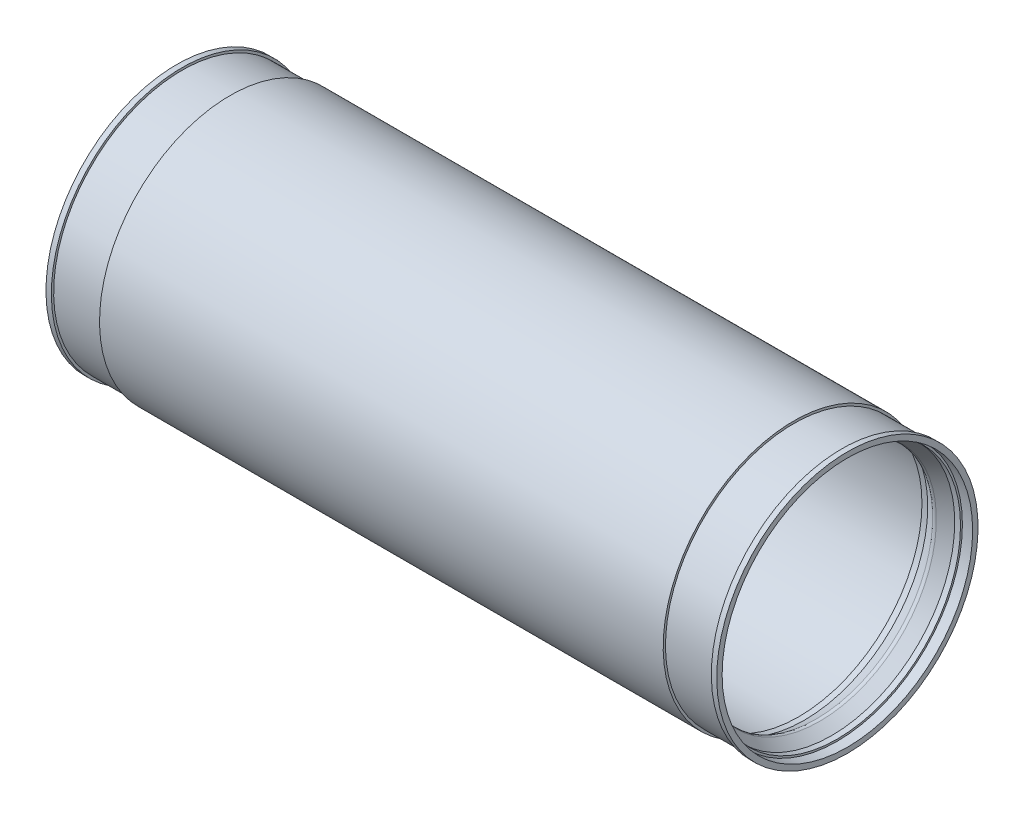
ISO-10303-21;
HEADER;
FILE_DESCRIPTION(('STEP AP214'),'2;1');
FILE_NAME('part.step','',(''),(''),'','','');
FILE_SCHEMA(('AUTOMOTIVE_DESIGN { 1 0 10303 214 1 1 1 1 }'));
ENDSEC;
DATA;
#1=APPLICATION_CONTEXT('core data for automotive mechanical design processes');
#2=APPLICATION_PROTOCOL_DEFINITION('international standard','automotive_design',2000,#1);
#3=PRODUCT_CONTEXT('',#1,'mechanical');
#4=PRODUCT('Part','Part','',(#3));
#5=PRODUCT_RELATED_PRODUCT_CATEGORY('part','',(#4));
#6=PRODUCT_DEFINITION_FORMATION('','',#4);
#7=PRODUCT_DEFINITION_CONTEXT('part definition',#1,'design');
#8=PRODUCT_DEFINITION('design','',#6,#7);
#9=PRODUCT_DEFINITION_SHAPE('','',#8);
#10=(LENGTH_UNIT() NAMED_UNIT(*) SI_UNIT(.MILLI.,.METRE.));
#11=(NAMED_UNIT(*) PLANE_ANGLE_UNIT() SI_UNIT($,.RADIAN.));
#12=(NAMED_UNIT(*) SI_UNIT($,.STERADIAN.) SOLID_ANGLE_UNIT());
#13=UNCERTAINTY_MEASURE_WITH_UNIT(LENGTH_MEASURE(1.E-05),#10,'distance_accuracy_value','');
#14=(GEOMETRIC_REPRESENTATION_CONTEXT(3) GLOBAL_UNCERTAINTY_ASSIGNED_CONTEXT((#13)) GLOBAL_UNIT_ASSIGNED_CONTEXT((#10,
#11,#12)) REPRESENTATION_CONTEXT('',''));
#15=CARTESIAN_POINT('',(0.,0.,0.));
#16=DIRECTION('',(0.,0.,1.));
#17=DIRECTION('',(1.,0.,0.));
#18=AXIS2_PLACEMENT_3D('',#15,#16,#17);
#19=CARTESIAN_POINT('',(-16.0133867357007,-82.55,0.));
#20=DIRECTION('',(-1.,0.,0.));
#21=DIRECTION('',(0.,-1.,0.));
#22=AXIS2_PLACEMENT_3D('',#19,#20,#21);
#23=CYLINDRICAL_SURFACE('',#22,82.55);
#24=CARTESIAN_POINT('',(6.73368093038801,-82.55,0.));
#25=DIRECTION('',(-1.,0.,0.));
#26=DIRECTION('',(0.,-1.,0.));
#27=AXIS2_PLACEMENT_3D('',#24,#25,#26);
#28=CIRCLE('',#27,82.55);
#29=CARTESIAN_POINT('',(6.73368093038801,-165.1,0.));
#30=VERTEX_POINT('',#29);
#31=EDGE_CURVE('E10',#30,#30,#28,.T.);
#32=ORIENTED_EDGE('',*,*,#31,.F.);
#33=EDGE_LOOP('',(#32));
#34=FACE_BOUND('',#33,.T.);
#35=CARTESIAN_POINT('',(0.,-82.55,0.));
#36=DIRECTION('',(-1.,0.,0.));
#37=DIRECTION('',(0.,-1.,0.));
#38=AXIS2_PLACEMENT_3D('',#35,#36,#37);
#39=CIRCLE('',#38,82.55);
#40=CARTESIAN_POINT('',(0.,-165.1,0.));
#41=VERTEX_POINT('',#40);
#42=EDGE_CURVE('E116',#41,#41,#39,.T.);
#43=ORIENTED_EDGE('',*,*,#42,.T.);
#44=EDGE_LOOP('',(#43));
#45=FACE_BOUND('',#44,.T.);
#46=ADVANCED_FACE('F28',(#34,#45),#23,.F.);
#47=CARTESIAN_POINT('',(6.73368093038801,-1.26435608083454,0.));
#48=DIRECTION('',(1.,0.,0.));
#49=DIRECTION('',(0.,1.,0.));
#50=AXIS2_PLACEMENT_3D('',#47,#48,#49);
#51=PLANE('',#50);
#52=CARTESIAN_POINT('',(6.73368093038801,-82.55,0.));
#53=DIRECTION('',(-1.,0.,0.));
#54=DIRECTION('',(0.,-1.,0.));
#55=AXIS2_PLACEMENT_3D('',#52,#53,#54);
#56=CIRCLE('',#55,81.2856439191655);
#57=CARTESIAN_POINT('',(6.73368093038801,-163.835643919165,0.));
#58=VERTEX_POINT('',#57);
#59=EDGE_CURVE('E34',#58,#58,#56,.T.);
#60=ORIENTED_EDGE('',*,*,#59,.F.);
#61=EDGE_LOOP('',(#60));
#62=FACE_BOUND('',#61,.T.);
#63=ORIENTED_EDGE('',*,*,#31,.T.);
#64=EDGE_LOOP('',(#63));
#65=FACE_BOUND('',#64,.T.);
#66=ADVANCED_FACE('F273',(#62,#65),#51,.F.);
#67=CARTESIAN_POINT('',(-16.0133867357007,-82.55,0.));
#68=DIRECTION('',(-1.,0.,0.));
#69=DIRECTION('',(0.,-1.,0.));
#70=AXIS2_PLACEMENT_3D('',#67,#68,#69);
#71=CYLINDRICAL_SURFACE('',#70,81.2856439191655);
#72=CARTESIAN_POINT('',(10.543680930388,-82.55,0.));
#73=DIRECTION('',(-1.,0.,0.));
#74=DIRECTION('',(0.,-1.,0.));
#75=AXIS2_PLACEMENT_3D('',#72,#73,#74);
#76=CIRCLE('',#75,81.2856439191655);
#77=CARTESIAN_POINT('',(10.543680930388,-163.835643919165,0.));
#78=VERTEX_POINT('',#77);
#79=EDGE_CURVE('E38',#78,#78,#76,.T.);
#80=ORIENTED_EDGE('',*,*,#79,.F.);
#81=EDGE_LOOP('',(#80));
#82=FACE_BOUND('',#81,.T.);
#83=ORIENTED_EDGE('',*,*,#59,.T.);
#84=EDGE_LOOP('',(#83));
#85=FACE_BOUND('',#84,.T.);
#86=ADVANCED_FACE('F268',(#82,#85),#71,.F.);
#87=CARTESIAN_POINT('',(10.543680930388,-82.55,0.));
#88=DIRECTION('',(-1.,0.,0.));
#89=DIRECTION('',(0.,-1.,0.));
#90=AXIS2_PLACEMENT_3D('',#87,#88,#89);
#91=CONICAL_SURFACE('',#90,81.2856439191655,0.580420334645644);
#92=CARTESIAN_POINT('',(18.0687160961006,-82.55,0.));
#93=DIRECTION('',(-1.,0.,0.));
#94=DIRECTION('',(0.,-1.,0.));
#95=AXIS2_PLACEMENT_3D('',#92,#93,#94);
#96=CIRCLE('',#95,76.3509563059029);
#97=CARTESIAN_POINT('',(18.0687160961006,-158.900956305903,0.));
#98=VERTEX_POINT('',#97);
#99=EDGE_CURVE('E42',#98,#98,#96,.T.);
#100=ORIENTED_EDGE('',*,*,#99,.F.);
#101=EDGE_LOOP('',(#100));
#102=FACE_BOUND('',#101,.T.);
#103=ORIENTED_EDGE('',*,*,#79,.T.);
#104=EDGE_LOOP('',(#103));
#105=FACE_BOUND('',#104,.T.);
#106=ADVANCED_FACE('F262',(#102,#105),#91,.F.);
#107=CARTESIAN_POINT('',(19.431,-82.55,0.));
#108=DIRECTION('',(-1.,0.,0.));
#109=DIRECTION('',(0.,-1.,0.));
#110=AXIS2_PLACEMENT_3D('',#107,#108,#109);
#111=TOROIDAL_SURFACE('',#110,79.2188488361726,3.175);
#112=CARTESIAN_POINT('',(20.8597836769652,-82.55,0.));
#113=DIRECTION('',(-1.,0.,0.));
#114=DIRECTION('',(0.,-1.,0.));
#115=AXIS2_PLACEMENT_3D('',#112,#113,#114);
#116=CIRCLE('',#115,76.3835001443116);
#117=CARTESIAN_POINT('',(20.8597836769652,-158.933500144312,0.));
#118=VERTEX_POINT('',#117);
#119=EDGE_CURVE('E47',#118,#118,#116,.T.);
#120=ORIENTED_EDGE('',*,*,#119,.F.);
#121=EDGE_LOOP('',(#120));
#122=FACE_BOUND('',#121,.T.);
#123=ORIENTED_EDGE('',*,*,#99,.T.);
#124=EDGE_LOOP('',(#123));
#125=FACE_BOUND('',#124,.T.);
#126=ADVANCED_FACE('F256',(#122,#125),#111,.T.);
#127=CARTESIAN_POINT('',(20.8597836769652,-82.55,0.));
#128=DIRECTION('',(1.,0.,0.));
#129=DIRECTION('',(0.,1.,0.));
#130=AXIS2_PLACEMENT_3D('',#127,#128,#129);
#131=CONICAL_SURFACE('',#130,76.3835001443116,0.466777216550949);
#132=CARTESIAN_POINT('',(28.4981397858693,-82.55,0.));
#133=DIRECTION('',(-1.,0.,0.));
#134=DIRECTION('',(0.,-1.,0.));
#135=AXIS2_PLACEMENT_3D('',#132,#133,#134);
#136=CIRCLE('',#135,80.2326064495);
#137=CARTESIAN_POINT('',(28.4981397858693,-162.7826064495,0.));
#138=VERTEX_POINT('',#137);
#139=EDGE_CURVE('E50',#138,#138,#136,.T.);
#140=ORIENTED_EDGE('',*,*,#139,.F.);
#141=EDGE_LOOP('',(#140));
#142=FACE_BOUND('',#141,.T.);
#143=ORIENTED_EDGE('',*,*,#119,.T.);
#144=EDGE_LOOP('',(#143));
#145=FACE_BOUND('',#144,.T.);
#146=ADVANCED_FACE('F250',(#142,#145),#131,.F.);
#147=CARTESIAN_POINT('',(-16.0133867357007,-82.55,0.));
#148=DIRECTION('',(-1.,0.,0.));
#149=DIRECTION('',(0.,-1.,0.));
#150=AXIS2_PLACEMENT_3D('',#147,#148,#149);
#151=CYLINDRICAL_SURFACE('',#150,80.2326064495);
#152=CARTESIAN_POINT('',(32.131,-82.55,0.));
#153=DIRECTION('',(-1.,0.,0.));
#154=DIRECTION('',(0.,-1.,0.));
#155=AXIS2_PLACEMENT_3D('',#152,#153,#154);
#156=CIRCLE('',#155,80.2326064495);
#157=CARTESIAN_POINT('',(32.131,-162.7826064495,0.));
#158=VERTEX_POINT('',#157);
#159=EDGE_CURVE('E53',#158,#158,#156,.T.);
#160=ORIENTED_EDGE('',*,*,#159,.F.);
#161=EDGE_LOOP('',(#160));
#162=FACE_BOUND('',#161,.T.);
#163=ORIENTED_EDGE('',*,*,#139,.T.);
#164=EDGE_LOOP('',(#163));
#165=FACE_BOUND('',#164,.T.);
#166=ADVANCED_FACE('F244',(#162,#165),#151,.F.);
#167=CARTESIAN_POINT('',(32.131,-2.31739355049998,0.));
#168=DIRECTION('',(-1.,0.,0.));
#169=DIRECTION('',(0.,-1.,0.));
#170=AXIS2_PLACEMENT_3D('',#167,#168,#169);
#171=PLANE('',#170);
#172=CARTESIAN_POINT('',(32.131,-82.55,0.));
#173=DIRECTION('',(-1.,0.,0.));
#174=DIRECTION('',(0.,-1.,0.));
#175=AXIS2_PLACEMENT_3D('',#172,#173,#174);
#176=CIRCLE('',#175,82.55);
#177=CARTESIAN_POINT('',(32.131,-165.1,0.));
#178=VERTEX_POINT('',#177);
#179=EDGE_CURVE('E56',#178,#178,#176,.T.);
#180=ORIENTED_EDGE('',*,*,#179,.F.);
#181=EDGE_LOOP('',(#180));
#182=FACE_BOUND('',#181,.T.);
#183=ORIENTED_EDGE('',*,*,#159,.T.);
#184=EDGE_LOOP('',(#183));
#185=FACE_BOUND('',#184,.T.);
#186=ADVANCED_FACE('F238',(#182,#185),#171,.F.);
#187=CARTESIAN_POINT('',(-16.0133867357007,-82.55,0.));
#188=DIRECTION('',(-1.,0.,0.));
#189=DIRECTION('',(0.,-1.,0.));
#190=AXIS2_PLACEMENT_3D('',#187,#188,#189);
#191=CYLINDRICAL_SURFACE('',#190,82.55);
#192=CARTESIAN_POINT('',(409.956,-82.55,0.));
#193=DIRECTION('',(-1.,0.,0.));
#194=DIRECTION('',(0.,-1.,0.));
#195=AXIS2_PLACEMENT_3D('',#192,#193,#194);
#196=CIRCLE('',#195,82.55);
#197=CARTESIAN_POINT('',(409.956,-165.1,0.));
#198=VERTEX_POINT('',#197);
#199=EDGE_CURVE('E59',#198,#198,#196,.T.);
#200=ORIENTED_EDGE('',*,*,#199,.F.);
#201=EDGE_LOOP('',(#200));
#202=FACE_BOUND('',#201,.T.);
#203=ORIENTED_EDGE('',*,*,#179,.T.);
#204=EDGE_LOOP('',(#203));
#205=FACE_BOUND('',#204,.T.);
#206=ADVANCED_FACE('F232',(#202,#205),#191,.F.);
#207=CARTESIAN_POINT('',(409.956,-1.27,0.));
#208=DIRECTION('',(1.,0.,0.));
#209=DIRECTION('',(0.,1.,0.));
#210=AXIS2_PLACEMENT_3D('',#207,#208,#209);
#211=PLANE('',#210);
#212=CARTESIAN_POINT('',(409.956,-82.55,0.));
#213=DIRECTION('',(-1.,0.,0.));
#214=DIRECTION('',(0.,-1.,0.));
#215=AXIS2_PLACEMENT_3D('',#212,#213,#214);
#216=CIRCLE('',#215,81.28);
#217=CARTESIAN_POINT('',(409.956,-163.83,0.));
#218=VERTEX_POINT('',#217);
#219=EDGE_CURVE('E62',#218,#218,#216,.T.);
#220=ORIENTED_EDGE('',*,*,#219,.F.);
#221=EDGE_LOOP('',(#220));
#222=FACE_BOUND('',#221,.T.);
#223=ORIENTED_EDGE('',*,*,#199,.T.);
#224=EDGE_LOOP('',(#223));
#225=FACE_BOUND('',#224,.T.);
#226=ADVANCED_FACE('F226',(#222,#225),#211,.F.);
#227=CARTESIAN_POINT('',(-16.0133867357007,-82.55,0.));
#228=DIRECTION('',(-1.,0.,0.));
#229=DIRECTION('',(0.,-1.,0.));
#230=AXIS2_PLACEMENT_3D('',#227,#228,#229);
#231=CYLINDRICAL_SURFACE('',#230,81.28);
#232=CARTESIAN_POINT('',(413.766,-82.55,0.));
#233=DIRECTION('',(-1.,0.,0.));
#234=DIRECTION('',(0.,-1.,0.));
#235=AXIS2_PLACEMENT_3D('',#232,#233,#234);
#236=CIRCLE('',#235,81.28);
#237=CARTESIAN_POINT('',(413.766,-163.83,0.));
#238=VERTEX_POINT('',#237);
#239=EDGE_CURVE('E65',#238,#238,#236,.T.);
#240=ORIENTED_EDGE('',*,*,#239,.F.);
#241=EDGE_LOOP('',(#240));
#242=FACE_BOUND('',#241,.T.);
#243=ORIENTED_EDGE('',*,*,#219,.T.);
#244=EDGE_LOOP('',(#243));
#245=FACE_BOUND('',#244,.T.);
#246=ADVANCED_FACE('F220',(#242,#245),#231,.F.);
#247=CARTESIAN_POINT('',(413.766,-82.55,0.));
#248=DIRECTION('',(-1.,0.,0.));
#249=DIRECTION('',(0.,-1.,0.));
#250=AXIS2_PLACEMENT_3D('',#247,#248,#249);
#251=CONICAL_SURFACE('',#250,81.28,0.523598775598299);
#252=CARTESIAN_POINT('',(421.423367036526,-82.55,0.));
#253=DIRECTION('',(-1.,0.,0.));
#254=DIRECTION('',(0.,-1.,0.));
#255=AXIS2_PLACEMENT_3D('',#252,#253,#254);
#256=CIRCLE('',#255,76.8590170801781);
#257=CARTESIAN_POINT('',(421.423367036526,-159.409017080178,0.));
#258=VERTEX_POINT('',#257);
#259=EDGE_CURVE('E68',#258,#258,#256,.T.);
#260=ORIENTED_EDGE('',*,*,#259,.F.);
#261=EDGE_LOOP('',(#260));
#262=FACE_BOUND('',#261,.T.);
#263=ORIENTED_EDGE('',*,*,#239,.T.);
#264=EDGE_LOOP('',(#263));
#265=FACE_BOUND('',#264,.T.);
#266=ADVANCED_FACE('F214',(#262,#265),#251,.F.);
#267=CARTESIAN_POINT('',(422.656,-82.55,0.));
#268=DIRECTION('',(-1.,0.,0.));
#269=DIRECTION('',(0.,-1.,0.));
#270=AXIS2_PLACEMENT_3D('',#267,#268,#269);
#271=TOROIDAL_SURFACE('',#270,78.994,2.4652659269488);
#272=CARTESIAN_POINT('',(423.888632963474,-82.55,0.));
#273=DIRECTION('',(-1.,0.,0.));
#274=DIRECTION('',(0.,-1.,0.));
#275=AXIS2_PLACEMENT_3D('',#272,#273,#274);
#276=CIRCLE('',#275,76.8590170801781);
#277=CARTESIAN_POINT('',(423.888632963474,-159.409017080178,0.));
#278=VERTEX_POINT('',#277);
#279=EDGE_CURVE('E71',#278,#278,#276,.T.);
#280=ORIENTED_EDGE('',*,*,#279,.F.);
#281=EDGE_LOOP('',(#280));
#282=FACE_BOUND('',#281,.T.);
#283=ORIENTED_EDGE('',*,*,#259,.T.);
#284=EDGE_LOOP('',(#283));
#285=FACE_BOUND('',#284,.T.);
#286=ADVANCED_FACE('F208',(#282,#285),#271,.T.);
#287=CARTESIAN_POINT('',(423.888632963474,-82.55,0.));
#288=DIRECTION('',(1.,0.,0.));
#289=DIRECTION('',(0.,1.,0.));
#290=AXIS2_PLACEMENT_3D('',#287,#288,#289);
#291=CONICAL_SURFACE('',#290,76.8590170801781,0.5235987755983);
#292=CARTESIAN_POINT('',(431.546,-82.55,0.));
#293=DIRECTION('',(-1.,0.,0.));
#294=DIRECTION('',(0.,-1.,0.));
#295=AXIS2_PLACEMENT_3D('',#292,#293,#294);
#296=CIRCLE('',#295,81.28);
#297=CARTESIAN_POINT('',(431.546,-163.83,0.));
#298=VERTEX_POINT('',#297);
#299=EDGE_CURVE('E74',#298,#298,#296,.T.);
#300=ORIENTED_EDGE('',*,*,#299,.F.);
#301=EDGE_LOOP('',(#300));
#302=FACE_BOUND('',#301,.T.);
#303=ORIENTED_EDGE('',*,*,#279,.T.);
#304=EDGE_LOOP('',(#303));
#305=FACE_BOUND('',#304,.T.);
#306=ADVANCED_FACE('F202',(#302,#305),#291,.F.);
#307=CARTESIAN_POINT('',(-16.0133867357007,-82.55,0.));
#308=DIRECTION('',(-1.,0.,0.));
#309=DIRECTION('',(0.,-1.,0.));
#310=AXIS2_PLACEMENT_3D('',#307,#308,#309);
#311=CYLINDRICAL_SURFACE('',#310,81.28);
#312=CARTESIAN_POINT('',(435.356,-82.55,0.));
#313=DIRECTION('',(-1.,0.,0.));
#314=DIRECTION('',(0.,-1.,0.));
#315=AXIS2_PLACEMENT_3D('',#312,#313,#314);
#316=CIRCLE('',#315,81.28);
#317=CARTESIAN_POINT('',(435.356,-163.83,0.));
#318=VERTEX_POINT('',#317);
#319=EDGE_CURVE('E77',#318,#318,#316,.T.);
#320=ORIENTED_EDGE('',*,*,#319,.F.);
#321=EDGE_LOOP('',(#320));
#322=FACE_BOUND('',#321,.T.);
#323=ORIENTED_EDGE('',*,*,#299,.T.);
#324=EDGE_LOOP('',(#323));
#325=FACE_BOUND('',#324,.T.);
#326=ADVANCED_FACE('F196',(#322,#325),#311,.F.);
#327=CARTESIAN_POINT('',(435.356,-1.27,0.));
#328=DIRECTION('',(-1.,0.,0.));
#329=DIRECTION('',(0.,-1.,0.));
#330=AXIS2_PLACEMENT_3D('',#327,#328,#329);
#331=PLANE('',#330);
#332=CARTESIAN_POINT('',(435.356,-82.55,0.));
#333=DIRECTION('',(-1.,0.,0.));
#334=DIRECTION('',(0.,-1.,0.));
#335=AXIS2_PLACEMENT_3D('',#332,#333,#334);
#336=CIRCLE('',#335,82.55);
#337=CARTESIAN_POINT('',(435.356,-165.1,0.));
#338=VERTEX_POINT('',#337);
#339=EDGE_CURVE('E80',#338,#338,#336,.T.);
#340=ORIENTED_EDGE('',*,*,#339,.F.);
#341=EDGE_LOOP('',(#340));
#342=FACE_BOUND('',#341,.T.);
#343=ORIENTED_EDGE('',*,*,#319,.T.);
#344=EDGE_LOOP('',(#343));
#345=FACE_BOUND('',#344,.T.);
#346=ADVANCED_FACE('F190',(#342,#345),#331,.F.);
#347=CARTESIAN_POINT('',(-16.0133867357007,-82.55,0.));
#348=DIRECTION('',(-1.,0.,0.));
#349=DIRECTION('',(0.,-1.,0.));
#350=AXIS2_PLACEMENT_3D('',#347,#348,#349);
#351=CYLINDRICAL_SURFACE('',#350,82.55);
#352=CARTESIAN_POINT('',(442.087,-82.55,0.));
#353=DIRECTION('',(-1.,0.,0.));
#354=DIRECTION('',(0.,-1.,0.));
#355=AXIS2_PLACEMENT_3D('',#352,#353,#354);
#356=CIRCLE('',#355,82.55);
#357=CARTESIAN_POINT('',(442.087,-165.1,0.));
#358=VERTEX_POINT('',#357);
#359=EDGE_CURVE('E83',#358,#358,#356,.T.);
#360=ORIENTED_EDGE('',*,*,#359,.F.);
#361=EDGE_LOOP('',(#360));
#362=FACE_BOUND('',#361,.T.);
#363=ORIENTED_EDGE('',*,*,#339,.T.);
#364=EDGE_LOOP('',(#363));
#365=FACE_BOUND('',#364,.T.);
#366=ADVANCED_FACE('F184',(#362,#365),#351,.F.);
#367=CARTESIAN_POINT('',(442.087,0.,0.));
#368=DIRECTION('',(-1.,0.,0.));
#369=DIRECTION('',(0.,-1.,0.));
#370=AXIS2_PLACEMENT_3D('',#367,#368,#369);
#371=PLANE('',#370);
#372=CARTESIAN_POINT('',(442.087,-82.55,0.));
#373=DIRECTION('',(-1.,0.,0.));
#374=DIRECTION('',(0.,-1.,0.));
#375=AXIS2_PLACEMENT_3D('',#372,#373,#374);
#376=CIRCLE('',#375,86.106);
#377=CARTESIAN_POINT('',(442.087,-168.656,0.));
#378=VERTEX_POINT('',#377);
#379=EDGE_CURVE('E86',#378,#378,#376,.T.);
#380=ORIENTED_EDGE('',*,*,#379,.F.);
#381=EDGE_LOOP('',(#380));
#382=FACE_BOUND('',#381,.T.);
#383=ORIENTED_EDGE('',*,*,#359,.T.);
#384=EDGE_LOOP('',(#383));
#385=FACE_BOUND('',#384,.T.);
#386=ADVANCED_FACE('F178',(#382,#385),#371,.F.);
#387=CARTESIAN_POINT('',(-16.0133867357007,-82.55,0.));
#388=DIRECTION('',(-1.,0.,0.));
#389=DIRECTION('',(0.,-1.,0.));
#390=AXIS2_PLACEMENT_3D('',#387,#388,#389);
#391=CYLINDRICAL_SURFACE('',#390,86.106);
#392=CARTESIAN_POINT('',(438.531,-82.55,0.));
#393=DIRECTION('',(-1.,0.,0.));
#394=DIRECTION('',(0.,-1.,0.));
#395=AXIS2_PLACEMENT_3D('',#392,#393,#394);
#396=CIRCLE('',#395,86.106);
#397=CARTESIAN_POINT('',(438.531,-168.656,0.));
#398=VERTEX_POINT('',#397);
#399=EDGE_CURVE('E89',#398,#398,#396,.T.);
#400=ORIENTED_EDGE('',*,*,#399,.F.);
#401=EDGE_LOOP('',(#400));
#402=FACE_BOUND('',#401,.T.);
#403=ORIENTED_EDGE('',*,*,#379,.T.);
#404=EDGE_LOOP('',(#403));
#405=FACE_BOUND('',#404,.T.);
#406=ADVANCED_FACE('F172',(#402,#405),#391,.T.);
#407=CARTESIAN_POINT('',(438.531,3.55599999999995,0.));
#408=DIRECTION('',(1.,0.,0.));
#409=DIRECTION('',(0.,1.,0.));
#410=AXIS2_PLACEMENT_3D('',#407,#408,#409);
#411=PLANE('',#410);
#412=CARTESIAN_POINT('',(438.531,-82.55,0.));
#413=DIRECTION('',(-1.,0.,0.));
#414=DIRECTION('',(0.,-1.,0.));
#415=AXIS2_PLACEMENT_3D('',#412,#413,#414);
#416=CIRCLE('',#415,84.582);
#417=CARTESIAN_POINT('',(438.531,-167.132,0.));
#418=VERTEX_POINT('',#417);
#419=EDGE_CURVE('E92',#418,#418,#416,.T.);
#420=ORIENTED_EDGE('',*,*,#419,.F.);
#421=EDGE_LOOP('',(#420));
#422=FACE_BOUND('',#421,.T.);
#423=ORIENTED_EDGE('',*,*,#399,.T.);
#424=EDGE_LOOP('',(#423));
#425=FACE_BOUND('',#424,.T.);
#426=ADVANCED_FACE('F166',(#422,#425),#411,.F.);
#427=CARTESIAN_POINT('',(-16.0133867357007,-82.55,0.));
#428=DIRECTION('',(-1.,0.,0.));
#429=DIRECTION('',(0.,-1.,0.));
#430=AXIS2_PLACEMENT_3D('',#427,#428,#429);
#431=CYLINDRICAL_SURFACE('',#430,84.582);
#432=CARTESIAN_POINT('',(406.781,-82.55,0.));
#433=DIRECTION('',(-1.,0.,0.));
#434=DIRECTION('',(0.,-1.,0.));
#435=AXIS2_PLACEMENT_3D('',#432,#433,#434);
#436=CIRCLE('',#435,84.582);
#437=CARTESIAN_POINT('',(406.781,-167.132,0.));
#438=VERTEX_POINT('',#437);
#439=EDGE_CURVE('E95',#438,#438,#436,.T.);
#440=ORIENTED_EDGE('',*,*,#439,.F.);
#441=EDGE_LOOP('',(#440));
#442=FACE_BOUND('',#441,.T.);
#443=ORIENTED_EDGE('',*,*,#419,.T.);
#444=EDGE_LOOP('',(#443));
#445=FACE_BOUND('',#444,.T.);
#446=ADVANCED_FACE('F160',(#442,#445),#431,.T.);
#447=CARTESIAN_POINT('',(406.781,2.03199999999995,0.));
#448=DIRECTION('',(-1.,0.,0.));
#449=DIRECTION('',(0.,-1.,0.));
#450=AXIS2_PLACEMENT_3D('',#447,#448,#449);
#451=PLANE('',#450);
#452=CARTESIAN_POINT('',(406.781,-82.55,0.));
#453=DIRECTION('',(-1.,0.,0.));
#454=DIRECTION('',(0.,-1.,0.));
#455=AXIS2_PLACEMENT_3D('',#452,#453,#454);
#456=CIRCLE('',#455,86.106);
#457=CARTESIAN_POINT('',(406.781,-168.656,0.));
#458=VERTEX_POINT('',#457);
#459=EDGE_CURVE('E98',#458,#458,#456,.T.);
#460=ORIENTED_EDGE('',*,*,#459,.F.);
#461=EDGE_LOOP('',(#460));
#462=FACE_BOUND('',#461,.T.);
#463=ORIENTED_EDGE('',*,*,#439,.T.);
#464=EDGE_LOOP('',(#463));
#465=FACE_BOUND('',#464,.T.);
#466=ADVANCED_FACE('F154',(#462,#465),#451,.F.);
#467=CARTESIAN_POINT('',(-16.0133867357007,-82.55,0.));
#468=DIRECTION('',(-1.,0.,0.));
#469=DIRECTION('',(0.,-1.,0.));
#470=AXIS2_PLACEMENT_3D('',#467,#468,#469);
#471=CYLINDRICAL_SURFACE('',#470,86.106);
#472=CARTESIAN_POINT('',(35.306,-82.55,0.));
#473=DIRECTION('',(-1.,0.,0.));
#474=DIRECTION('',(0.,-1.,0.));
#475=AXIS2_PLACEMENT_3D('',#472,#473,#474);
#476=CIRCLE('',#475,86.106);
#477=CARTESIAN_POINT('',(35.306,-168.656,0.));
#478=VERTEX_POINT('',#477);
#479=EDGE_CURVE('E101',#478,#478,#476,.T.);
#480=ORIENTED_EDGE('',*,*,#479,.F.);
#481=EDGE_LOOP('',(#480));
#482=FACE_BOUND('',#481,.T.);
#483=ORIENTED_EDGE('',*,*,#459,.T.);
#484=EDGE_LOOP('',(#483));
#485=FACE_BOUND('',#484,.T.);
#486=ADVANCED_FACE('F148',(#482,#485),#471,.T.);
#487=CARTESIAN_POINT('',(35.306,2.032,0.));
#488=DIRECTION('',(1.,0.,0.));
#489=DIRECTION('',(0.,1.,0.));
#490=AXIS2_PLACEMENT_3D('',#487,#488,#489);
#491=PLANE('',#490);
#492=CARTESIAN_POINT('',(35.306,-82.55,0.));
#493=DIRECTION('',(-1.,0.,0.));
#494=DIRECTION('',(0.,-1.,0.));
#495=AXIS2_PLACEMENT_3D('',#492,#493,#494);
#496=CIRCLE('',#495,84.582);
#497=CARTESIAN_POINT('',(35.306,-167.132,0.));
#498=VERTEX_POINT('',#497);
#499=EDGE_CURVE('E104',#498,#498,#496,.T.);
#500=ORIENTED_EDGE('',*,*,#499,.F.);
#501=EDGE_LOOP('',(#500));
#502=FACE_BOUND('',#501,.T.);
#503=ORIENTED_EDGE('',*,*,#479,.T.);
#504=EDGE_LOOP('',(#503));
#505=FACE_BOUND('',#504,.T.);
#506=ADVANCED_FACE('F142',(#502,#505),#491,.F.);
#507=CARTESIAN_POINT('',(-16.0133867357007,-82.55,0.));
#508=DIRECTION('',(-1.,0.,0.));
#509=DIRECTION('',(0.,-1.,0.));
#510=AXIS2_PLACEMENT_3D('',#507,#508,#509);
#511=CYLINDRICAL_SURFACE('',#510,84.582);
#512=CARTESIAN_POINT('',(3.556,-82.55,0.));
#513=DIRECTION('',(-1.,0.,0.));
#514=DIRECTION('',(0.,-1.,0.));
#515=AXIS2_PLACEMENT_3D('',#512,#513,#514);
#516=CIRCLE('',#515,84.582);
#517=CARTESIAN_POINT('',(3.55599999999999,-167.132,0.));
#518=VERTEX_POINT('',#517);
#519=EDGE_CURVE('E107',#518,#518,#516,.T.);
#520=ORIENTED_EDGE('',*,*,#519,.F.);
#521=EDGE_LOOP('',(#520));
#522=FACE_BOUND('',#521,.T.);
#523=ORIENTED_EDGE('',*,*,#499,.T.);
#524=EDGE_LOOP('',(#523));
#525=FACE_BOUND('',#524,.T.);
#526=ADVANCED_FACE('F136',(#522,#525),#511,.T.);
#527=CARTESIAN_POINT('',(3.556,3.556,0.));
#528=DIRECTION('',(-1.,0.,0.));
#529=DIRECTION('',(0.,-1.,0.));
#530=AXIS2_PLACEMENT_3D('',#527,#528,#529);
#531=PLANE('',#530);
#532=CARTESIAN_POINT('',(3.556,-82.55,0.));
#533=DIRECTION('',(-1.,0.,0.));
#534=DIRECTION('',(0.,-1.,0.));
#535=AXIS2_PLACEMENT_3D('',#532,#533,#534);
#536=CIRCLE('',#535,86.106);
#537=CARTESIAN_POINT('',(3.55599999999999,-168.656,0.));
#538=VERTEX_POINT('',#537);
#539=EDGE_CURVE('E110',#538,#538,#536,.T.);
#540=ORIENTED_EDGE('',*,*,#539,.F.);
#541=EDGE_LOOP('',(#540));
#542=FACE_BOUND('',#541,.T.);
#543=ORIENTED_EDGE('',*,*,#519,.T.);
#544=EDGE_LOOP('',(#543));
#545=FACE_BOUND('',#544,.T.);
#546=ADVANCED_FACE('F130',(#542,#545),#531,.F.);
#547=CARTESIAN_POINT('',(-16.0133867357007,-82.55,0.));
#548=DIRECTION('',(-1.,0.,0.));
#549=DIRECTION('',(0.,-1.,0.));
#550=AXIS2_PLACEMENT_3D('',#547,#548,#549);
#551=CYLINDRICAL_SURFACE('',#550,86.106);
#552=CARTESIAN_POINT('',(0.,-82.55,0.));
#553=DIRECTION('',(-1.,0.,0.));
#554=DIRECTION('',(0.,-1.,0.));
#555=AXIS2_PLACEMENT_3D('',#552,#553,#554);
#556=CIRCLE('',#555,86.106);
#557=CARTESIAN_POINT('',(0.,-168.656,0.));
#558=VERTEX_POINT('',#557);
#559=EDGE_CURVE('E113',#558,#558,#556,.T.);
#560=ORIENTED_EDGE('',*,*,#559,.F.);
#561=EDGE_LOOP('',(#560));
#562=FACE_BOUND('',#561,.T.);
#563=ORIENTED_EDGE('',*,*,#539,.T.);
#564=EDGE_LOOP('',(#563));
#565=FACE_BOUND('',#564,.T.);
#566=ADVANCED_FACE('F124',(#562,#565),#551,.T.);
#567=CARTESIAN_POINT('',(0.,0.,0.));
#568=DIRECTION('',(1.,0.,0.));
#569=DIRECTION('',(0.,1.,0.));
#570=AXIS2_PLACEMENT_3D('',#567,#568,#569);
#571=PLANE('',#570);
#572=ORIENTED_EDGE('',*,*,#42,.F.);
#573=EDGE_LOOP('',(#572));
#574=FACE_BOUND('',#573,.T.);
#575=ORIENTED_EDGE('',*,*,#559,.T.);
#576=EDGE_LOOP('',(#575));
#577=FACE_BOUND('',#576,.T.);
#578=ADVANCED_FACE('F121',(#574,#577),#571,.F.);
#579=CLOSED_SHELL('',(#46,#66,#86,#106,#126,#146,#166,#186,#206,#226,#246,#266,#286,#306,#326,
#346,#366,#386,#406,#426,#446,#466,#486,#506,#526,#546,#566,#578));
#580=MANIFOLD_SOLID_BREP('B2',#579);
#581=ADVANCED_BREP_SHAPE_REPRESENTATION('',(#18,#580),#14);
#582=SHAPE_DEFINITION_REPRESENTATION(#9,#581);
ENDSEC;
END-ISO-10303-21;
